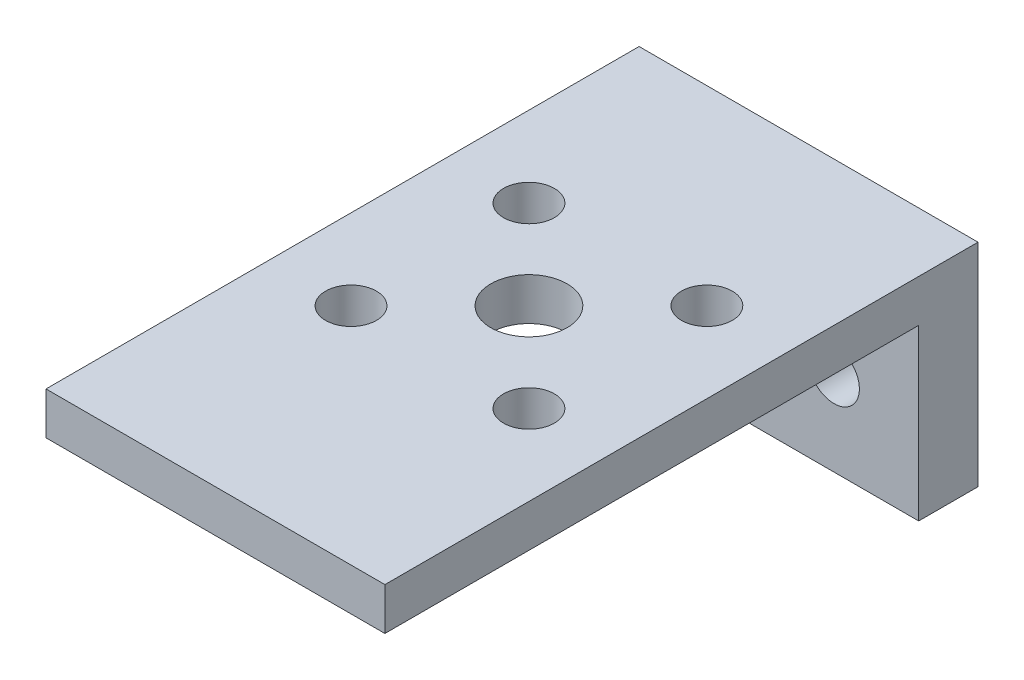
from build123d import *

# Parameters (mm, degrees)
SKETCH2_W           = 40
SKETCH2_H           = 70
BOSS_EXTRUDE1_DEPTH = 5
SKETCH4_W           = 40
SKETCH4_H           = 7
BOSS_EXTRUDE2_DEPTH = 20
SKETCH5_R           = 3
CUT_EXTRUDE1_DEPTH  = 20
SKETCH6_R           = 4.5
SKETCH6_R_2         = 3
CUT_EXTRUDE2_DEPTH  = 10


with BuildPart() as part:
    # Sketch2 → Boss-Extrude1 (new body)
    with BuildSketch(Plane(origin=(0, 0, 0), x_dir=(1, 0, 0), z_dir=(0, 1, 0))):
        Rectangle(SKETCH2_W, SKETCH2_H)
    extrude(amount=BOSS_EXTRUDE1_DEPTH)

    # Sketch4 → Boss-Extrude2 (add)
    with BuildSketch(Plane.XZ):
        with Locations((0, -31.5)):
            Rectangle(SKETCH4_W, SKETCH4_H)
    extrude(amount=BOSS_EXTRUDE2_DEPTH)

    # Sketch5 → Cut-Extrude1 (cut)
    with BuildSketch(Plane.XY.offset(-28)):
        with Locations((-10, -10)):
            Circle(SKETCH5_R)
        with Locations((10, -10)):
            Circle(SKETCH5_R)
    extrude(amount=-CUT_EXTRUDE1_DEPTH, mode=Mode.SUBTRACT)

    # Sketch6 → Cut-Extrude2 (cut)
    with BuildSketch(Plane.XZ):
        with Locations(Location((0, -2, 0), (0, 0, 270))):
            Circle(SKETCH6_R)
        with Locations(Location((10.5, 8.5, 0), (0, 0, 270))):
            Circle(SKETCH6_R_2)
        with Locations(Location((-10.5, -12.5, 0), (0, 0, 270))):
            Circle(SKETCH6_R_2)
        with Locations(Location((10.5, -12.5, 0), (0, 0, 270))):
            Circle(SKETCH6_R_2)
        with Locations(Location((-10.5, 8.5, 0), (0, 0, 270))):
            Circle(SKETCH6_R_2)
    extrude(amount=-CUT_EXTRUDE2_DEPTH, mode=Mode.SUBTRACT)


solid = part.part
